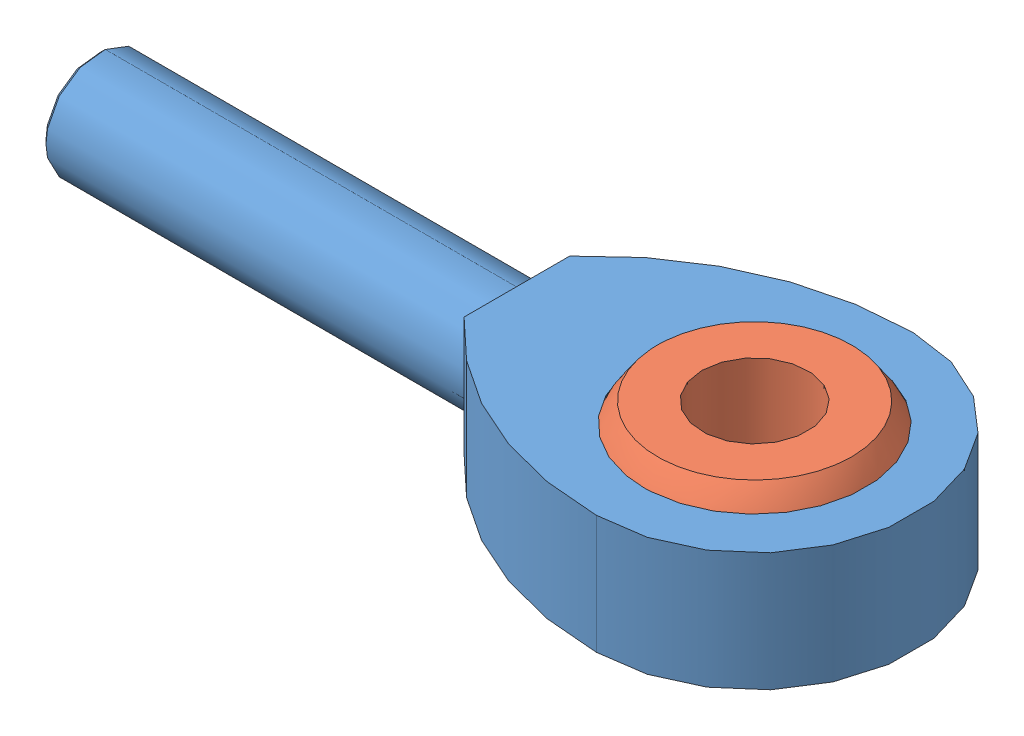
SolidWorks assembly Rod End Assembly.SLDASM, configuration Default (file format 4400). Lengths in mm.
Overall size (49.23 67.48 19.05).
2 component instances, 2 part files, 4 mates.
Components (placement in the parent):
- Rod End Outter-1: Rod End Outter.SLDPRT [Default] at origin size (49.23 67.48 19.05)
- Spherical - Inner-1: Spherical - Inner.SLDPRT [Default] at origin size (15.06 9.53 15.06)
Mates (geometry in assembly coordinates):
- Coincident1: coincident aligned: plane of Rod End Outter-1; plane of assembly
- Coincident2: coincident aligned: plane of Rod End Outter-1; plane of assembly
- Coincident3: coincident aligned: plane of Rod End Outter-1; plane of assembly
- Concentric1: concentric: sphere of Rod End Outter-1; sphere of Spherical - Inner-1
